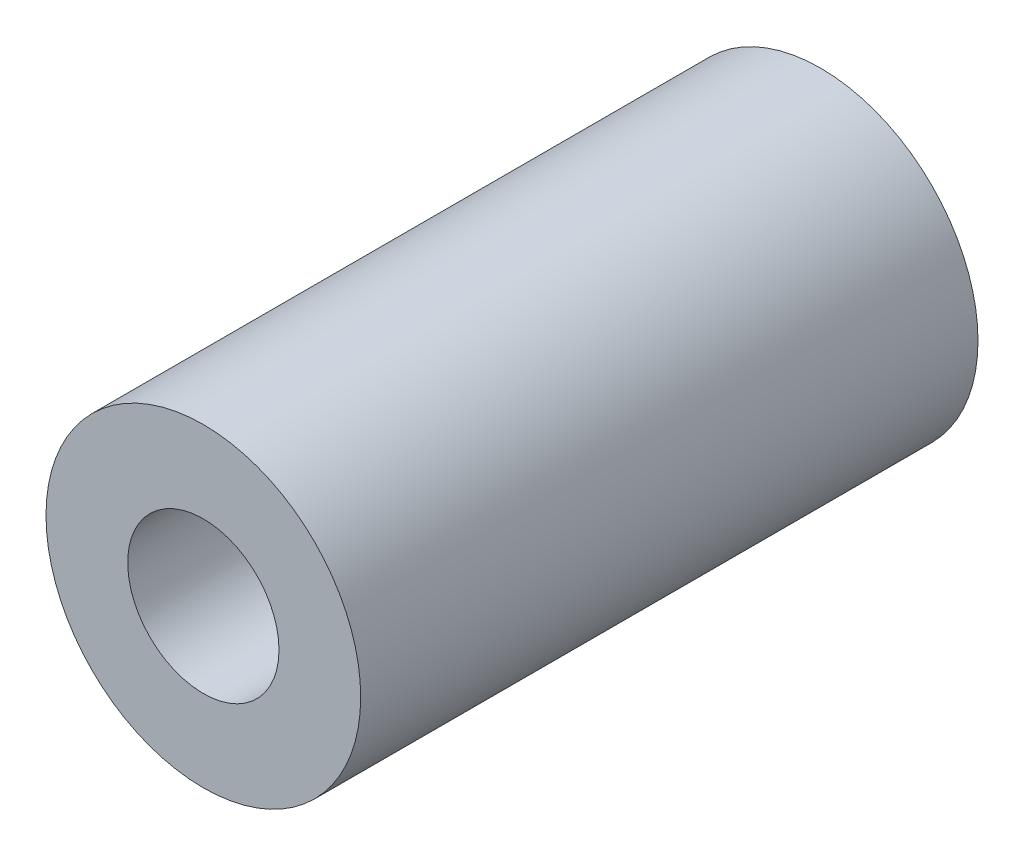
ISO-10303-21;
HEADER;
FILE_DESCRIPTION(('STEP AP214'),'2;1');
FILE_NAME('part.step','',(''),(''),'','','');
FILE_SCHEMA(('AUTOMOTIVE_DESIGN { 1 0 10303 214 1 1 1 1 }'));
ENDSEC;
DATA;
#1=APPLICATION_CONTEXT('core data for automotive mechanical design processes');
#2=APPLICATION_PROTOCOL_DEFINITION('international standard','automotive_design',2000,#1);
#3=PRODUCT_CONTEXT('',#1,'mechanical');
#4=PRODUCT('Part','Part','',(#3));
#5=PRODUCT_RELATED_PRODUCT_CATEGORY('part','',(#4));
#6=PRODUCT_DEFINITION_FORMATION('','',#4);
#7=PRODUCT_DEFINITION_CONTEXT('part definition',#1,'design');
#8=PRODUCT_DEFINITION('design','',#6,#7);
#9=PRODUCT_DEFINITION_SHAPE('','',#8);
#10=(LENGTH_UNIT() NAMED_UNIT(*) SI_UNIT(.MILLI.,.METRE.));
#11=(NAMED_UNIT(*) PLANE_ANGLE_UNIT() SI_UNIT($,.RADIAN.));
#12=(NAMED_UNIT(*) SI_UNIT($,.STERADIAN.) SOLID_ANGLE_UNIT());
#13=UNCERTAINTY_MEASURE_WITH_UNIT(LENGTH_MEASURE(1.E-05),#10,'distance_accuracy_value','');
#14=(GEOMETRIC_REPRESENTATION_CONTEXT(3) GLOBAL_UNCERTAINTY_ASSIGNED_CONTEXT((#13)) GLOBAL_UNIT_ASSIGNED_CONTEXT((#10,
#11,#12)) REPRESENTATION_CONTEXT('',''));
#15=CARTESIAN_POINT('',(0.,0.,0.));
#16=DIRECTION('',(0.,0.,1.));
#17=DIRECTION('',(1.,0.,0.));
#18=AXIS2_PLACEMENT_3D('',#15,#16,#17);
#19=CARTESIAN_POINT('',(0.,0.,51.));
#20=DIRECTION('',(0.,0.,1.));
#21=DIRECTION('',(1.,0.,0.));
#22=AXIS2_PLACEMENT_3D('',#19,#20,#21);
#23=PLANE('',#22);
#24=CARTESIAN_POINT('',(0.,0.,51.));
#25=DIRECTION('',(0.,0.,1.));
#26=DIRECTION('',(1.,0.,0.));
#27=AXIS2_PLACEMENT_3D('',#24,#25,#26);
#28=CIRCLE('',#27,13.);
#29=CARTESIAN_POINT('',(13.,0.,51.));
#30=VERTEX_POINT('',#29);
#31=EDGE_CURVE('E9',#30,#30,#28,.T.);
#32=ORIENTED_EDGE('',*,*,#31,.T.);
#33=EDGE_LOOP('',(#32));
#34=FACE_BOUND('',#33,.T.);
#35=CARTESIAN_POINT('',(0.,0.,51.));
#36=DIRECTION('',(0.,0.,1.));
#37=DIRECTION('',(1.,0.,0.));
#38=AXIS2_PLACEMENT_3D('',#35,#36,#37);
#39=CIRCLE('',#38,6.25);
#40=CARTESIAN_POINT('',(6.25,0.,51.));
#41=VERTEX_POINT('',#40);
#42=EDGE_CURVE('E25',#41,#41,#39,.T.);
#43=ORIENTED_EDGE('',*,*,#42,.F.);
#44=EDGE_LOOP('',(#43));
#45=FACE_BOUND('',#44,.T.);
#46=ADVANCED_FACE('F14',(#34,#45),#23,.T.);
#47=CARTESIAN_POINT('',(0.,0.,0.));
#48=DIRECTION('',(0.,0.,1.));
#49=DIRECTION('',(1.,0.,0.));
#50=AXIS2_PLACEMENT_3D('',#47,#48,#49);
#51=PLANE('',#50);
#52=CARTESIAN_POINT('',(0.,0.,0.));
#53=DIRECTION('',(0.,0.,1.));
#54=DIRECTION('',(1.,0.,0.));
#55=AXIS2_PLACEMENT_3D('',#52,#53,#54);
#56=CIRCLE('',#55,13.);
#57=CARTESIAN_POINT('',(13.,0.,0.));
#58=VERTEX_POINT('',#57);
#59=EDGE_CURVE('E18',#58,#58,#56,.T.);
#60=ORIENTED_EDGE('',*,*,#59,.F.);
#61=EDGE_LOOP('',(#60));
#62=FACE_BOUND('',#61,.T.);
#63=CARTESIAN_POINT('',(0.,0.,0.));
#64=DIRECTION('',(0.,0.,1.));
#65=DIRECTION('',(1.,0.,0.));
#66=AXIS2_PLACEMENT_3D('',#63,#64,#65);
#67=CIRCLE('',#66,6.25);
#68=CARTESIAN_POINT('',(6.25,0.,0.));
#69=VERTEX_POINT('',#68);
#70=EDGE_CURVE('E27',#69,#69,#67,.T.);
#71=ORIENTED_EDGE('',*,*,#70,.T.);
#72=EDGE_LOOP('',(#71));
#73=FACE_BOUND('',#72,.T.);
#74=ADVANCED_FACE('F37',(#62,#73),#51,.F.);
#75=CARTESIAN_POINT('',(0.,0.,51.));
#76=DIRECTION('',(0.,0.,-1.));
#77=DIRECTION('',(-1.,0.,0.));
#78=AXIS2_PLACEMENT_3D('',#75,#76,#77);
#79=CYLINDRICAL_SURFACE('',#78,13.);
#80=ORIENTED_EDGE('',*,*,#31,.F.);
#81=EDGE_LOOP('',(#80));
#82=FACE_BOUND('',#81,.T.);
#83=ORIENTED_EDGE('',*,*,#59,.T.);
#84=EDGE_LOOP('',(#83));
#85=FACE_BOUND('',#84,.T.);
#86=ADVANCED_FACE('F16',(#82,#85),#79,.T.);
#87=CARTESIAN_POINT('',(0.,0.,51.));
#88=DIRECTION('',(0.,0.,-1.));
#89=DIRECTION('',(-1.,0.,0.));
#90=AXIS2_PLACEMENT_3D('',#87,#88,#89);
#91=CYLINDRICAL_SURFACE('',#90,6.25);
#92=ORIENTED_EDGE('',*,*,#42,.T.);
#93=EDGE_LOOP('',(#92));
#94=FACE_BOUND('',#93,.T.);
#95=ORIENTED_EDGE('',*,*,#70,.F.);
#96=EDGE_LOOP('',(#95));
#97=FACE_BOUND('',#96,.T.);
#98=ADVANCED_FACE('F33',(#94,#97),#91,.F.);
#99=CLOSED_SHELL('',(#46,#74,#86,#98));
#100=MANIFOLD_SOLID_BREP('B1',#99);
#101=ADVANCED_BREP_SHAPE_REPRESENTATION('',(#18,#100),#14);
#102=SHAPE_DEFINITION_REPRESENTATION(#9,#101);
ENDSEC;
END-ISO-10303-21;
